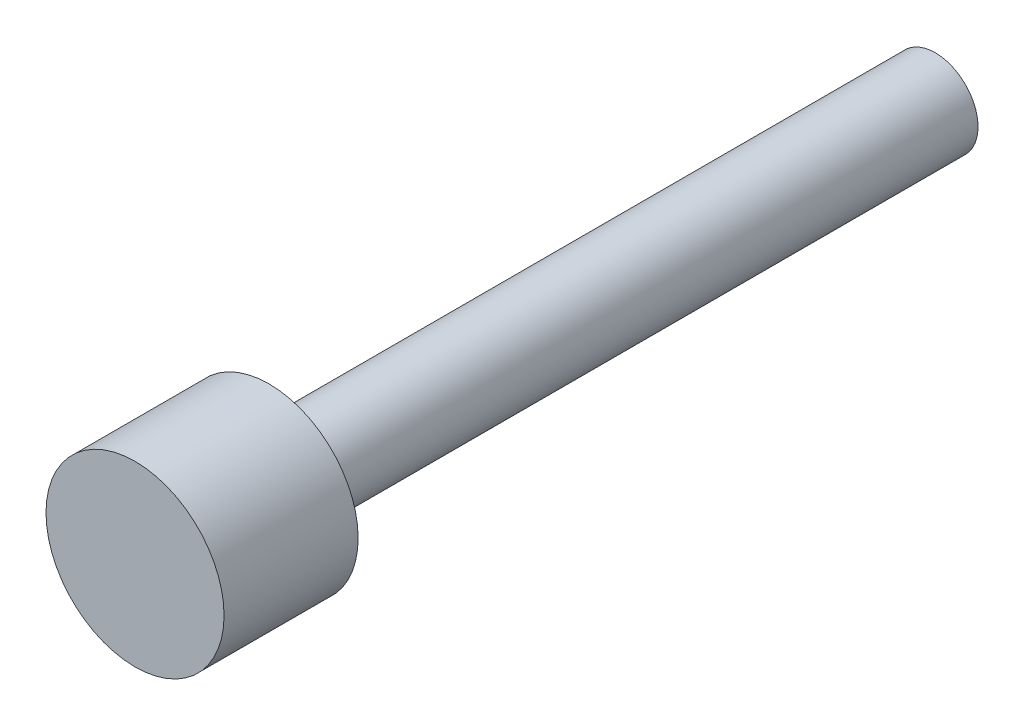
from build123d import *

# Parameters (mm, degrees)
SKETCH1_R           = 8.5
BOSS_EXTRUDE1_DEPTH = 12.8
SKETCH2_R           = 4.08
BOSS_EXTRUDE2_DEPTH = 63.6


with BuildPart() as part:
    # Sketch1 → Boss-Extrude1 (new body)
    with BuildSketch(Plane.XY):
        Circle(SKETCH1_R)
    extrude(amount=-BOSS_EXTRUDE1_DEPTH)

    # Sketch2 → Boss-Extrude2 (add)
    with BuildSketch(Plane(origin=(0, 0, -12.8), x_dir=(-1, 0, 0), z_dir=(0, 0, -1))):
        with Locations(Location((0, 0, 0), (0, 0, 90))):
            Circle(SKETCH2_R)
    extrude(amount=BOSS_EXTRUDE2_DEPTH)


solid = part.part
